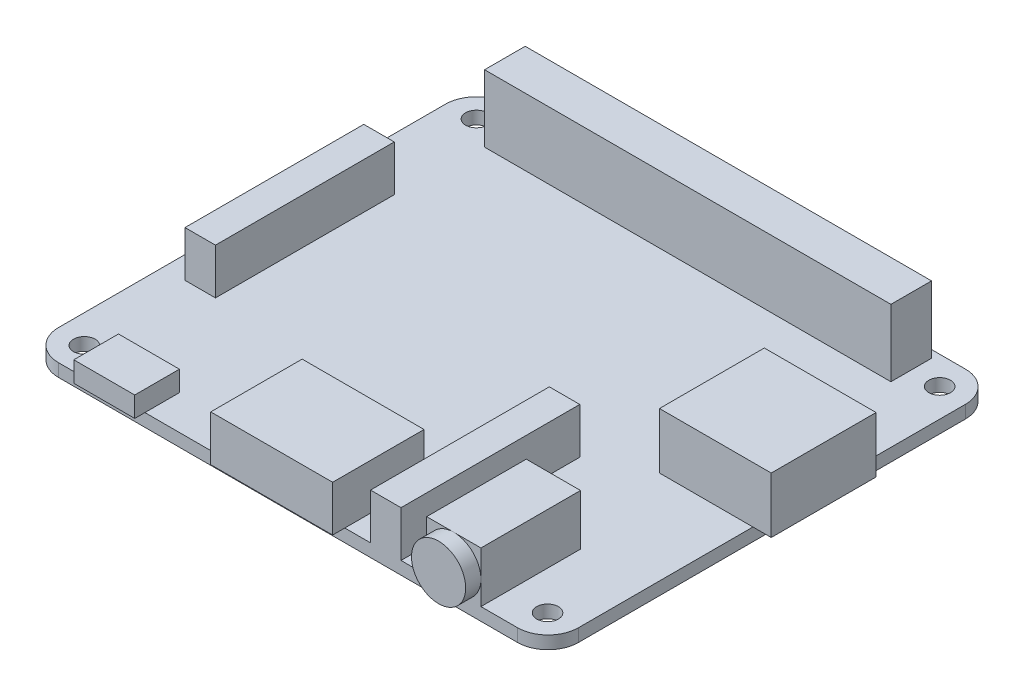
from build123d import *

# Parameters (mm, degrees)
SKETCH1_W                 = 65
SKETCH1_H                 = 56
BOSS_EXTRUDE1_DEPTH       = 1.6002
FILLET1_R                 = 3.81
F_2_CLEARANCE_HOLE1_D     = 2.7051
F_2_CLEARANCE_HOLE1_DEPTH = 7.62
F_2_CLEARANCE_HOLE1_TIP   = 0.81269403
SKETCH5_W                 = 13.97
SKETCH5_H                 = 13.1064
BOSS_EXTRUDE2_DEPTH       = 6.985
SKETCH6_W                 = 50.8
SKETCH6_H                 = 5.08
BOSS_EXTRUDE3_DEPTH       = 8.382
SKETCH7_W                 = 3.81
SKETCH7_H                 = 22.352
BOSS_EXTRUDE4_DEPTH       = 5.715
SKETCH8_W                 = 15.24
SKETCH8_H                 = 11.43
BOSS_EXTRUDE5_DEPTH       = 5.715
SKETCH9_W                 = 6.7818
SKETCH9_H                 = 12.446
BOSS_EXTRUDE6_DEPTH       = 6.35
SKETCH10_R                = 3.3909
BOSS_EXTRUDE7_DEPTH       = 1.905
SKETCH11_W                = 3.81
SKETCH11_H                = 22.352
BOSS_EXTRUDE8_DEPTH       = 5.715
SKETCH12_W                = 7.62
SKETCH12_H                = 5.588
BOSS_EXTRUDE9_DEPTH       = 2.54
SKETCH13_W                = 13.97
SKETCH13_H                = 13.081
BOSS_EXTRUDE10_DEPTH      = 1.27


with BuildPart() as part:
    # Sketch1 → Boss-Extrude1 (new body)
    with BuildSketch(Plane(origin=(0, 0, 0), x_dir=(1, 0, 0), z_dir=(0, 1, 0))):
        Rectangle(SKETCH1_W, SKETCH1_H)
    extrude(amount=BOSS_EXTRUDE1_DEPTH)

    # Fillet1
    fillet1_edges = [part.edges().sort_by_distance(p)[0] for p in [
        (-32.5, 0.8001, -28),
        (32.5, 0.8001, -28),
        (32.5, 0.8001, 28),
        (-32.5, 0.8001, 28),
    ]]
    fillet(fillet1_edges, radius=FILLET1_R)

    # 2 Clearance Hole1
    with Locations(Plane(origin=(0, 1.6002, 0), x_dir=(1, 0, 0), z_dir=(0, 1, 0))):
        with Locations((-28.956, 24.511), (-28.956, -24.511), (28.956, -24.511), (28.956, 24.511)):
            Hole(F_2_CLEARANCE_HOLE1_D / 2, depth=F_2_CLEARANCE_HOLE1_DEPTH)
            with Locations((0, 0, -(F_2_CLEARANCE_HOLE1_DEPTH + F_2_CLEARANCE_HOLE1_TIP / 2))):  # 118° drill point
                Cone(0, F_2_CLEARANCE_HOLE1_D / 2, F_2_CLEARANCE_HOLE1_TIP, mode=Mode.SUBTRACT)

    # Sketch5 → Boss-Extrude2 (add)
    with BuildSketch(Plane(origin=(0, 1.6002, 0), x_dir=(1, 0, 0), z_dir=(0, 1, 0))):
        with Locations((27.801, 4.1748)):
            Rectangle(SKETCH5_W, SKETCH5_H)
    extrude(amount=BOSS_EXTRUDE2_DEPTH)

    # Sketch6 → Boss-Extrude3 (add)
    with BuildSketch(Plane(origin=(0, 1.6002, 0), x_dir=(1, 0, 0), z_dir=(0, 1, 0))):
        with Locations((0, 24.511)):
            Rectangle(SKETCH6_W, SKETCH6_H)
    extrude(amount=BOSS_EXTRUDE3_DEPTH)

    # Sketch7 → Boss-Extrude4 (add)
    with BuildSketch(Plane(origin=(0, 1.6002, 0), x_dir=(1, 0, 0), z_dir=(0, 1, 0))):
        with Locations((-27.801, 0)):
            Rectangle(SKETCH7_W, SKETCH7_H)
    extrude(amount=BOSS_EXTRUDE4_DEPTH)

    # Sketch8 → Boss-Extrude5 (add)
    with BuildSketch(Plane(origin=(0, 1.6002, 0), x_dir=(1, 0, 0), z_dir=(0, 1, 0))):
        with Locations((-0.52, -23.809)):
            Rectangle(SKETCH8_W, SKETCH8_H)
    extrude(amount=BOSS_EXTRUDE5_DEPTH)

    # Sketch9 → Boss-Extrude6 (add)
    with BuildSketch(Plane(origin=(0, 1.6002, 0), x_dir=(1, 0, 0), z_dir=(0, 1, 0))):
        with Locations((20.7271, -21.777)):
            Rectangle(SKETCH9_W, SKETCH9_H)
    extrude(amount=BOSS_EXTRUDE6_DEPTH)

    # Sketch10 → Boss-Extrude7 (add)
    with BuildSketch(Plane.XY.offset(28)):
        with Locations((20.7271, 4.5593)):
            Circle(SKETCH10_R)
    extrude(amount=BOSS_EXTRUDE7_DEPTH)

    # Sketch11 → Boss-Extrude8 (add)
    with BuildSketch(Plane(origin=(0, 1.6002, 0), x_dir=(1, 0, 0), z_dir=(0, 1, 0))):
        with Locations((12.2181, -16.824)):
            Rectangle(SKETCH11_W, SKETCH11_H)
    extrude(amount=BOSS_EXTRUDE8_DEPTH)

    # Sketch12 → Boss-Extrude9 (add)
    with BuildSketch(Plane(origin=(0, 1.6002, 0), x_dir=(1, 0, 0), z_dir=(0, 1, 0))):
        with Locations((-21.705, -26.476)):
            Rectangle(SKETCH12_W, SKETCH12_H)
    extrude(amount=BOSS_EXTRUDE9_DEPTH)

    # Sketch13 → Boss-Extrude10 (add)
    with BuildSketch(Plane.XZ):
        with Locations((-25.515, -0.1305)):
            Rectangle(SKETCH13_W, SKETCH13_H)
    extrude(amount=BOSS_EXTRUDE10_DEPTH)


solid = part.part
